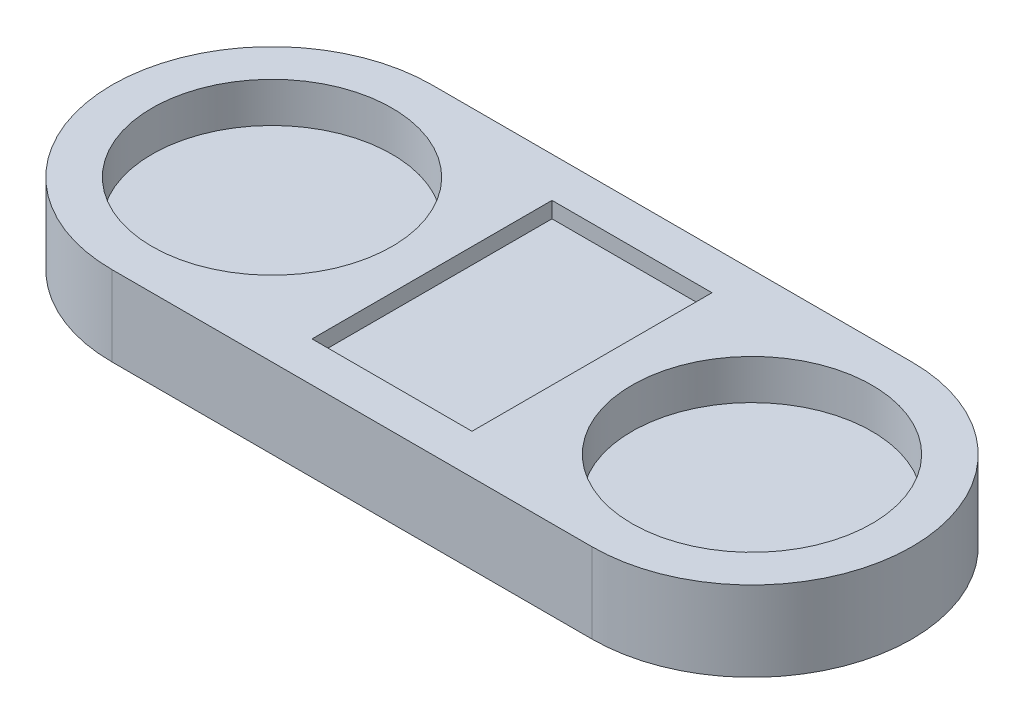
ISO-10303-21;
HEADER;
FILE_DESCRIPTION(('STEP AP214'),'2;1');
FILE_NAME('part.step','',(''),(''),'','','');
FILE_SCHEMA(('AUTOMOTIVE_DESIGN { 1 0 10303 214 1 1 1 1 }'));
ENDSEC;
DATA;
#1=APPLICATION_CONTEXT('core data for automotive mechanical design processes');
#2=APPLICATION_PROTOCOL_DEFINITION('international standard','automotive_design',2000,#1);
#3=PRODUCT_CONTEXT('',#1,'mechanical');
#4=PRODUCT('Part','Part','',(#3));
#5=PRODUCT_RELATED_PRODUCT_CATEGORY('part','',(#4));
#6=PRODUCT_DEFINITION_FORMATION('','',#4);
#7=PRODUCT_DEFINITION_CONTEXT('part definition',#1,'design');
#8=PRODUCT_DEFINITION('design','',#6,#7);
#9=PRODUCT_DEFINITION_SHAPE('','',#8);
#10=(LENGTH_UNIT() NAMED_UNIT(*) SI_UNIT(.MILLI.,.METRE.));
#11=(NAMED_UNIT(*) PLANE_ANGLE_UNIT() SI_UNIT($,.RADIAN.));
#12=(NAMED_UNIT(*) SI_UNIT($,.STERADIAN.) SOLID_ANGLE_UNIT());
#13=UNCERTAINTY_MEASURE_WITH_UNIT(LENGTH_MEASURE(1.E-05),#10,'distance_accuracy_value','');
#14=(GEOMETRIC_REPRESENTATION_CONTEXT(3) GLOBAL_UNCERTAINTY_ASSIGNED_CONTEXT((#13)) GLOBAL_UNIT_ASSIGNED_CONTEXT((#10,
#11,#12)) REPRESENTATION_CONTEXT('',''));
#15=CARTESIAN_POINT('',(0.,0.,0.));
#16=DIRECTION('',(0.,0.,1.));
#17=DIRECTION('',(1.,0.,0.));
#18=AXIS2_PLACEMENT_3D('',#15,#16,#17);
#19=CARTESIAN_POINT('',(38.1,0.,0.));
#20=DIRECTION('',(0.,-1.,0.));
#21=DIRECTION('',(0.,0.,-1.));
#22=AXIS2_PLACEMENT_3D('',#19,#20,#21);
#23=CYLINDRICAL_SURFACE('',#22,25.4);
#24=DIRECTION('',(0.,-1.,0.));
#25=VECTOR('',#24,1.);
#26=CARTESIAN_POINT('',(38.1,12.7,25.4));
#27=LINE('',#26,#25);
#28=CARTESIAN_POINT('',(38.1,0.,25.4));
#29=VERTEX_POINT('',#28);
#30=CARTESIAN_POINT('',(38.1,12.7,25.4));
#31=VERTEX_POINT('',#30);
#32=EDGE_CURVE('E173',#29,#31,#27,.F.);
#33=ORIENTED_EDGE('',*,*,#32,.F.);
#34=CARTESIAN_POINT('',(38.1,0.,0.));
#35=DIRECTION('',(0.,1.,0.));
#36=DIRECTION('',(0.,0.,1.));
#37=AXIS2_PLACEMENT_3D('',#34,#35,#36);
#38=CIRCLE('',#37,25.4);
#39=CARTESIAN_POINT('',(38.1,0.,-25.4));
#40=VERTEX_POINT('',#39);
#41=EDGE_CURVE('E46',#40,#29,#38,.F.);
#42=ORIENTED_EDGE('',*,*,#41,.F.);
#43=DIRECTION('',(0.,-1.,0.));
#44=VECTOR('',#43,1.);
#45=CARTESIAN_POINT('',(38.1,12.7,-25.4));
#46=LINE('',#45,#44);
#47=CARTESIAN_POINT('',(38.1,12.7,-25.4));
#48=VERTEX_POINT('',#47);
#49=EDGE_CURVE('E176',#48,#40,#46,.T.);
#50=ORIENTED_EDGE('',*,*,#49,.F.);
#51=CARTESIAN_POINT('',(38.1,12.7,0.));
#52=DIRECTION('',(0.,1.,0.));
#53=DIRECTION('',(0.,0.,1.));
#54=AXIS2_PLACEMENT_3D('',#51,#52,#53);
#55=CIRCLE('',#54,25.4);
#56=EDGE_CURVE('E11',#31,#48,#55,.T.);
#57=ORIENTED_EDGE('',*,*,#56,.F.);
#58=EDGE_LOOP('',(#33,#42,#50,#57));
#59=FACE_BOUND('',#58,.T.);
#60=ADVANCED_FACE('F39',(#59),#23,.T.);
#61=CARTESIAN_POINT('',(-38.1,12.7,0.));
#62=DIRECTION('',(0.,-1.,0.));
#63=DIRECTION('',(0.,0.,-1.));
#64=AXIS2_PLACEMENT_3D('',#61,#62,#63);
#65=CYLINDRICAL_SURFACE('',#64,25.4);
#66=DIRECTION('',(0.,-1.,0.));
#67=VECTOR('',#66,1.);
#68=CARTESIAN_POINT('',(-38.1,12.7,25.4));
#69=LINE('',#68,#67);
#70=CARTESIAN_POINT('',(-38.1,12.7,25.4));
#71=VERTEX_POINT('',#70);
#72=CARTESIAN_POINT('',(-38.1,0.,25.4));
#73=VERTEX_POINT('',#72);
#74=EDGE_CURVE('E162',#71,#73,#69,.T.);
#75=ORIENTED_EDGE('',*,*,#74,.F.);
#76=CARTESIAN_POINT('',(-38.1,12.7,0.));
#77=DIRECTION('',(0.,1.,0.));
#78=DIRECTION('',(0.,0.,1.));
#79=AXIS2_PLACEMENT_3D('',#76,#77,#78);
#80=CIRCLE('',#79,25.4);
#81=CARTESIAN_POINT('',(-38.1,12.7,-25.4));
#82=VERTEX_POINT('',#81);
#83=EDGE_CURVE('E168',#82,#71,#80,.T.);
#84=ORIENTED_EDGE('',*,*,#83,.F.);
#85=DIRECTION('',(0.,-1.,0.));
#86=VECTOR('',#85,1.);
#87=CARTESIAN_POINT('',(-38.1,12.7,-25.4));
#88=LINE('',#87,#86);
#89=CARTESIAN_POINT('',(-38.1,0.,-25.4));
#90=VERTEX_POINT('',#89);
#91=EDGE_CURVE('E165',#90,#82,#88,.F.);
#92=ORIENTED_EDGE('',*,*,#91,.F.);
#93=CARTESIAN_POINT('',(-38.1,0.,0.));
#94=DIRECTION('',(0.,1.,0.));
#95=DIRECTION('',(0.,0.,1.));
#96=AXIS2_PLACEMENT_3D('',#93,#94,#95);
#97=CIRCLE('',#96,25.4);
#98=EDGE_CURVE('E170',#73,#90,#97,.F.);
#99=ORIENTED_EDGE('',*,*,#98,.F.);
#100=EDGE_LOOP('',(#75,#84,#92,#99));
#101=FACE_BOUND('',#100,.T.);
#102=ADVANCED_FACE('F190',(#101),#65,.T.);
#103=CARTESIAN_POINT('',(-63.5,12.7,25.4));
#104=DIRECTION('',(0.,0.,-1.));
#105=DIRECTION('',(-1.,0.,0.));
#106=AXIS2_PLACEMENT_3D('',#103,#104,#105);
#107=PLANE('',#106);
#108=DIRECTION('',(1.,0.,0.));
#109=VECTOR('',#108,1.);
#110=CARTESIAN_POINT('',(-63.5,0.,25.4));
#111=LINE('',#110,#109);
#112=EDGE_CURVE('E153',#73,#29,#111,.T.);
#113=ORIENTED_EDGE('',*,*,#112,.T.);
#114=ORIENTED_EDGE('',*,*,#32,.T.);
#115=DIRECTION('',(1.,0.,0.));
#116=VECTOR('',#115,1.);
#117=CARTESIAN_POINT('',(-63.5,12.7,25.4));
#118=LINE('',#117,#116);
#119=EDGE_CURVE('E158',#71,#31,#118,.T.);
#120=ORIENTED_EDGE('',*,*,#119,.F.);
#121=ORIENTED_EDGE('',*,*,#74,.T.);
#122=EDGE_LOOP('',(#113,#114,#120,#121));
#123=FACE_BOUND('',#122,.T.);
#124=ADVANCED_FACE('F186',(#123),#107,.F.);
#125=CARTESIAN_POINT('',(-63.5,12.7,-25.4));
#126=DIRECTION('',(0.,0.,1.));
#127=DIRECTION('',(1.,0.,0.));
#128=AXIS2_PLACEMENT_3D('',#125,#126,#127);
#129=PLANE('',#128);
#130=DIRECTION('',(-1.,0.,0.));
#131=VECTOR('',#130,1.);
#132=CARTESIAN_POINT('',(-63.5,12.7,-25.4));
#133=LINE('',#132,#131);
#134=EDGE_CURVE('E160',#48,#82,#133,.T.);
#135=ORIENTED_EDGE('',*,*,#134,.F.);
#136=ORIENTED_EDGE('',*,*,#49,.T.);
#137=DIRECTION('',(-1.,0.,0.));
#138=VECTOR('',#137,1.);
#139=CARTESIAN_POINT('',(-63.5,0.,-25.4));
#140=LINE('',#139,#138);
#141=EDGE_CURVE('E156',#40,#90,#140,.T.);
#142=ORIENTED_EDGE('',*,*,#141,.T.);
#143=ORIENTED_EDGE('',*,*,#91,.T.);
#144=EDGE_LOOP('',(#135,#136,#142,#143));
#145=FACE_BOUND('',#144,.T.);
#146=ADVANCED_FACE('F194',(#145),#129,.F.);
#147=CARTESIAN_POINT('',(-63.5,12.7,25.4));
#148=DIRECTION('',(0.,1.,0.));
#149=DIRECTION('',(0.,0.,1.));
#150=AXIS2_PLACEMENT_3D('',#147,#148,#149);
#151=PLANE('',#150);
#152=DIRECTION('',(0.,0.,-1.));
#153=VECTOR('',#152,1.);
#154=CARTESIAN_POINT('',(12.7,12.7,-19.05));
#155=LINE('',#154,#153);
#156=CARTESIAN_POINT('',(12.7,12.7,19.05));
#157=VERTEX_POINT('',#156);
#158=CARTESIAN_POINT('',(12.7,12.7,-19.05));
#159=VERTEX_POINT('',#158);
#160=EDGE_CURVE('E53',#157,#159,#155,.T.);
#161=ORIENTED_EDGE('',*,*,#160,.F.);
#162=DIRECTION('',(1.,0.,0.));
#163=VECTOR('',#162,1.);
#164=CARTESIAN_POINT('',(12.7,12.7,19.05));
#165=LINE('',#164,#163);
#166=CARTESIAN_POINT('',(-12.7,12.7,19.05));
#167=VERTEX_POINT('',#166);
#168=EDGE_CURVE('E123',#167,#157,#165,.T.);
#169=ORIENTED_EDGE('',*,*,#168,.F.);
#170=DIRECTION('',(0.,0.,1.));
#171=VECTOR('',#170,1.);
#172=CARTESIAN_POINT('',(-12.7,12.7,-19.05));
#173=LINE('',#172,#171);
#174=CARTESIAN_POINT('',(-12.7,12.7,-19.05));
#175=VERTEX_POINT('',#174);
#176=EDGE_CURVE('E105',#175,#167,#173,.T.);
#177=ORIENTED_EDGE('',*,*,#176,.F.);
#178=DIRECTION('',(-1.,0.,0.));
#179=VECTOR('',#178,1.);
#180=CARTESIAN_POINT('',(12.7,12.7,-19.05));
#181=LINE('',#180,#179);
#182=EDGE_CURVE('E116',#159,#175,#181,.T.);
#183=ORIENTED_EDGE('',*,*,#182,.F.);
#184=EDGE_LOOP('',(#161,#169,#177,#183));
#185=FACE_BOUND('',#184,.T.);
#186=CARTESIAN_POINT('',(38.1,12.7,0.));
#187=DIRECTION('',(0.,1.,0.));
#188=DIRECTION('',(0.,0.,1.));
#189=AXIS2_PLACEMENT_3D('',#186,#187,#188);
#190=CIRCLE('',#189,19.05);
#191=CARTESIAN_POINT('',(38.1,12.7,19.05));
#192=VERTEX_POINT('',#191);
#193=EDGE_CURVE('E139',#192,#192,#190,.T.);
#194=ORIENTED_EDGE('',*,*,#193,.F.);
#195=EDGE_LOOP('',(#194));
#196=FACE_BOUND('',#195,.T.);
#197=CARTESIAN_POINT('',(-38.1,12.7,0.));
#198=DIRECTION('',(0.,1.,0.));
#199=DIRECTION('',(0.,0.,1.));
#200=AXIS2_PLACEMENT_3D('',#197,#198,#199);
#201=CIRCLE('',#200,19.05);
#202=CARTESIAN_POINT('',(-38.1,12.7,19.05));
#203=VERTEX_POINT('',#202);
#204=EDGE_CURVE('E147',#203,#203,#201,.T.);
#205=ORIENTED_EDGE('',*,*,#204,.F.);
#206=EDGE_LOOP('',(#205));
#207=FACE_BOUND('',#206,.T.);
#208=ORIENTED_EDGE('',*,*,#119,.T.);
#209=ORIENTED_EDGE('',*,*,#56,.T.);
#210=ORIENTED_EDGE('',*,*,#134,.T.);
#211=ORIENTED_EDGE('',*,*,#83,.T.);
#212=EDGE_LOOP('',(#208,#209,#210,#211));
#213=FACE_BOUND('',#212,.T.);
#214=ADVANCED_FACE('F120',(#185,#196,#207,#213),#151,.T.);
#215=CARTESIAN_POINT('',(-63.5,0.,25.4));
#216=DIRECTION('',(0.,1.,0.));
#217=DIRECTION('',(0.,0.,1.));
#218=AXIS2_PLACEMENT_3D('',#215,#216,#217);
#219=PLANE('',#218);
#220=ORIENTED_EDGE('',*,*,#141,.F.);
#221=ORIENTED_EDGE('',*,*,#41,.T.);
#222=ORIENTED_EDGE('',*,*,#112,.F.);
#223=ORIENTED_EDGE('',*,*,#98,.T.);
#224=EDGE_LOOP('',(#220,#221,#222,#223));
#225=FACE_BOUND('',#224,.T.);
#226=ADVANCED_FACE('F182',(#225),#219,.F.);
#227=CARTESIAN_POINT('',(-38.1,6.35,0.));
#228=DIRECTION('',(0.,1.,0.));
#229=DIRECTION('',(0.,0.,1.));
#230=AXIS2_PLACEMENT_3D('',#227,#228,#229);
#231=CYLINDRICAL_SURFACE('',#230,19.05);
#232=CARTESIAN_POINT('',(-38.1,6.35,0.));
#233=DIRECTION('',(0.,1.,0.));
#234=DIRECTION('',(0.,0.,1.));
#235=AXIS2_PLACEMENT_3D('',#232,#233,#234);
#236=CIRCLE('',#235,19.05);
#237=CARTESIAN_POINT('',(-38.1,6.35,19.05));
#238=VERTEX_POINT('',#237);
#239=EDGE_CURVE('E150',#238,#238,#236,.T.);
#240=ORIENTED_EDGE('',*,*,#239,.F.);
#241=EDGE_LOOP('',(#240));
#242=FACE_BOUND('',#241,.T.);
#243=ORIENTED_EDGE('',*,*,#204,.T.);
#244=EDGE_LOOP('',(#243));
#245=FACE_BOUND('',#244,.T.);
#246=ADVANCED_FACE('F201',(#242,#245),#231,.F.);
#247=CARTESIAN_POINT('',(-38.1,6.35,0.));
#248=DIRECTION('',(0.,1.,0.));
#249=DIRECTION('',(0.,0.,1.));
#250=AXIS2_PLACEMENT_3D('',#247,#248,#249);
#251=PLANE('',#250);
#252=ORIENTED_EDGE('',*,*,#239,.T.);
#253=EDGE_LOOP('',(#252));
#254=FACE_BOUND('',#253,.T.);
#255=ADVANCED_FACE('F240',(#254),#251,.T.);
#256=CARTESIAN_POINT('',(38.1,6.35,0.));
#257=DIRECTION('',(0.,1.,0.));
#258=DIRECTION('',(0.,0.,1.));
#259=AXIS2_PLACEMENT_3D('',#256,#257,#258);
#260=CYLINDRICAL_SURFACE('',#259,19.05);
#261=CARTESIAN_POINT('',(38.1,6.35,0.));
#262=DIRECTION('',(0.,1.,0.));
#263=DIRECTION('',(0.,0.,1.));
#264=AXIS2_PLACEMENT_3D('',#261,#262,#263);
#265=CIRCLE('',#264,19.05);
#266=CARTESIAN_POINT('',(38.1,6.35,19.05));
#267=VERTEX_POINT('',#266);
#268=EDGE_CURVE('E144',#267,#267,#265,.T.);
#269=ORIENTED_EDGE('',*,*,#268,.F.);
#270=EDGE_LOOP('',(#269));
#271=FACE_BOUND('',#270,.T.);
#272=ORIENTED_EDGE('',*,*,#193,.T.);
#273=EDGE_LOOP('',(#272));
#274=FACE_BOUND('',#273,.T.);
#275=ADVANCED_FACE('F250',(#271,#274),#260,.F.);
#276=CARTESIAN_POINT('',(38.1,6.35,0.));
#277=DIRECTION('',(0.,1.,0.));
#278=DIRECTION('',(0.,0.,1.));
#279=AXIS2_PLACEMENT_3D('',#276,#277,#278);
#280=PLANE('',#279);
#281=ORIENTED_EDGE('',*,*,#268,.T.);
#282=EDGE_LOOP('',(#281));
#283=FACE_BOUND('',#282,.T.);
#284=ADVANCED_FACE('F260',(#283),#280,.T.);
#285=CARTESIAN_POINT('',(12.7,10.16,-19.05));
#286=DIRECTION('',(1.,0.,0.));
#287=DIRECTION('',(0.,0.,-1.));
#288=AXIS2_PLACEMENT_3D('',#285,#286,#287);
#289=PLANE('',#288);
#290=ORIENTED_EDGE('',*,*,#160,.T.);
#291=DIRECTION('',(0.,1.,0.));
#292=VECTOR('',#291,1.);
#293=CARTESIAN_POINT('',(12.7,10.16,-19.05));
#294=LINE('',#293,#292);
#295=CARTESIAN_POINT('',(12.7,10.16,-19.05));
#296=VERTEX_POINT('',#295);
#297=EDGE_CURVE('E113',#296,#159,#294,.T.);
#298=ORIENTED_EDGE('',*,*,#297,.F.);
#299=DIRECTION('',(0.,0.,-1.));
#300=VECTOR('',#299,1.);
#301=CARTESIAN_POINT('',(12.7,10.16,-19.05));
#302=LINE('',#301,#300);
#303=CARTESIAN_POINT('',(12.7,10.16,19.05));
#304=VERTEX_POINT('',#303);
#305=EDGE_CURVE('E125',#304,#296,#302,.T.);
#306=ORIENTED_EDGE('',*,*,#305,.F.);
#307=DIRECTION('',(0.,1.,0.));
#308=VECTOR('',#307,1.);
#309=CARTESIAN_POINT('',(12.7,10.16,19.05));
#310=LINE('',#309,#308);
#311=EDGE_CURVE('E137',#304,#157,#310,.T.);
#312=ORIENTED_EDGE('',*,*,#311,.T.);
#313=EDGE_LOOP('',(#290,#298,#306,#312));
#314=FACE_BOUND('',#313,.T.);
#315=ADVANCED_FACE('F268',(#314),#289,.F.);
#316=CARTESIAN_POINT('',(12.7,10.16,19.05));
#317=DIRECTION('',(0.,0.,1.));
#318=DIRECTION('',(1.,0.,0.));
#319=AXIS2_PLACEMENT_3D('',#316,#317,#318);
#320=PLANE('',#319);
#321=ORIENTED_EDGE('',*,*,#168,.T.);
#322=ORIENTED_EDGE('',*,*,#311,.F.);
#323=DIRECTION('',(1.,0.,0.));
#324=VECTOR('',#323,1.);
#325=CARTESIAN_POINT('',(12.7,10.16,19.05));
#326=LINE('',#325,#324);
#327=CARTESIAN_POINT('',(-12.7,10.16,19.05));
#328=VERTEX_POINT('',#327);
#329=EDGE_CURVE('E134',#328,#304,#326,.T.);
#330=ORIENTED_EDGE('',*,*,#329,.F.);
#331=DIRECTION('',(0.,1.,0.));
#332=VECTOR('',#331,1.);
#333=CARTESIAN_POINT('',(-12.7,10.16,19.05));
#334=LINE('',#333,#332);
#335=EDGE_CURVE('E112',#328,#167,#334,.T.);
#336=ORIENTED_EDGE('',*,*,#335,.T.);
#337=EDGE_LOOP('',(#321,#322,#330,#336));
#338=FACE_BOUND('',#337,.T.);
#339=ADVANCED_FACE('F277',(#338),#320,.F.);
#340=CARTESIAN_POINT('',(-12.7,10.16,-19.05));
#341=DIRECTION('',(-1.,0.,0.));
#342=DIRECTION('',(0.,0.,1.));
#343=AXIS2_PLACEMENT_3D('',#340,#341,#342);
#344=PLANE('',#343);
#345=ORIENTED_EDGE('',*,*,#176,.T.);
#346=ORIENTED_EDGE('',*,*,#335,.F.);
#347=DIRECTION('',(0.,0.,1.));
#348=VECTOR('',#347,1.);
#349=CARTESIAN_POINT('',(-12.7,10.16,-19.05));
#350=LINE('',#349,#348);
#351=CARTESIAN_POINT('',(-12.7,10.16,-19.05));
#352=VERTEX_POINT('',#351);
#353=EDGE_CURVE('E108',#352,#328,#350,.T.);
#354=ORIENTED_EDGE('',*,*,#353,.F.);
#355=DIRECTION('',(0.,1.,0.));
#356=VECTOR('',#355,1.);
#357=CARTESIAN_POINT('',(-12.7,10.16,-19.05));
#358=LINE('',#357,#356);
#359=EDGE_CURVE('E101',#352,#175,#358,.T.);
#360=ORIENTED_EDGE('',*,*,#359,.T.);
#361=EDGE_LOOP('',(#345,#346,#354,#360));
#362=FACE_BOUND('',#361,.T.);
#363=ADVANCED_FACE('F103',(#362),#344,.F.);
#364=CARTESIAN_POINT('',(12.7,10.16,-19.05));
#365=DIRECTION('',(0.,0.,-1.));
#366=DIRECTION('',(-1.,0.,0.));
#367=AXIS2_PLACEMENT_3D('',#364,#365,#366);
#368=PLANE('',#367);
#369=ORIENTED_EDGE('',*,*,#182,.T.);
#370=ORIENTED_EDGE('',*,*,#359,.F.);
#371=DIRECTION('',(-1.,0.,0.));
#372=VECTOR('',#371,1.);
#373=CARTESIAN_POINT('',(12.7,10.16,-19.05));
#374=LINE('',#373,#372);
#375=EDGE_CURVE('E131',#296,#352,#374,.T.);
#376=ORIENTED_EDGE('',*,*,#375,.F.);
#377=ORIENTED_EDGE('',*,*,#297,.T.);
#378=EDGE_LOOP('',(#369,#370,#376,#377));
#379=FACE_BOUND('',#378,.T.);
#380=ADVANCED_FACE('F117',(#379),#368,.F.);
#381=CARTESIAN_POINT('',(12.7,10.16,19.05));
#382=DIRECTION('',(0.,-1.,0.));
#383=DIRECTION('',(0.,0.,-1.));
#384=AXIS2_PLACEMENT_3D('',#381,#382,#383);
#385=PLANE('',#384);
#386=ORIENTED_EDGE('',*,*,#305,.T.);
#387=ORIENTED_EDGE('',*,*,#375,.T.);
#388=ORIENTED_EDGE('',*,*,#353,.T.);
#389=ORIENTED_EDGE('',*,*,#329,.T.);
#390=EDGE_LOOP('',(#386,#387,#388,#389));
#391=FACE_BOUND('',#390,.T.);
#392=ADVANCED_FACE('F303',(#391),#385,.F.);
#393=CLOSED_SHELL('',(#60,#102,#124,#146,#214,#226,#246,#255,#275,#284,#315,#339,#363,#380,#392));
#394=MANIFOLD_SOLID_BREP('B2',#393);
#395=ADVANCED_BREP_SHAPE_REPRESENTATION('',(#18,#394),#14);
#396=SHAPE_DEFINITION_REPRESENTATION(#9,#395);
ENDSEC;
END-ISO-10303-21;
